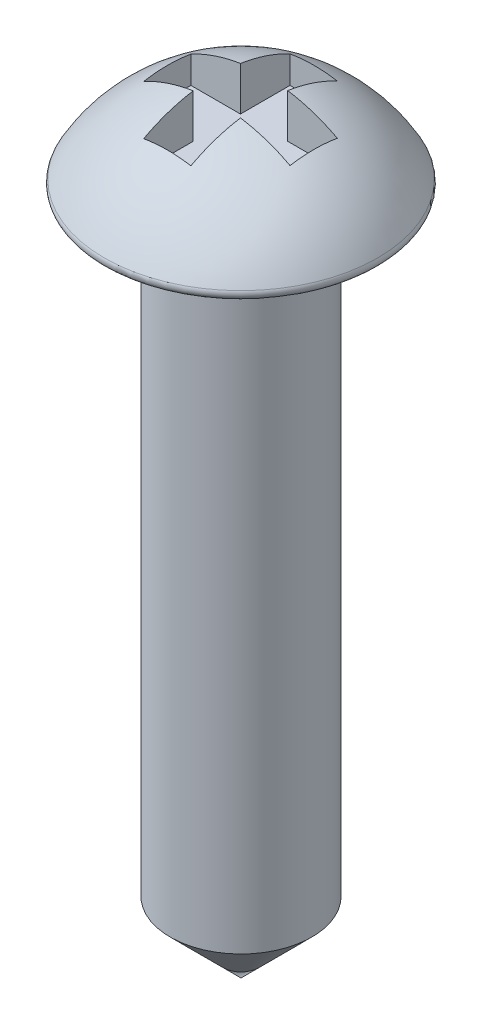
ISO-10303-21;
HEADER;
FILE_DESCRIPTION(('STEP AP214'),'2;1');
FILE_NAME('part.step','',(''),(''),'','','');
FILE_SCHEMA(('AUTOMOTIVE_DESIGN { 1 0 10303 214 1 1 1 1 }'));
ENDSEC;
DATA;
#1=APPLICATION_CONTEXT('core data for automotive mechanical design processes');
#2=APPLICATION_PROTOCOL_DEFINITION('international standard','automotive_design',2000,#1);
#3=PRODUCT_CONTEXT('',#1,'mechanical');
#4=PRODUCT('Part','Part','',(#3));
#5=PRODUCT_RELATED_PRODUCT_CATEGORY('part','',(#4));
#6=PRODUCT_DEFINITION_FORMATION('','',#4);
#7=PRODUCT_DEFINITION_CONTEXT('part definition',#1,'design');
#8=PRODUCT_DEFINITION('design','',#6,#7);
#9=PRODUCT_DEFINITION_SHAPE('','',#8);
#10=(LENGTH_UNIT() NAMED_UNIT(*) SI_UNIT(.MILLI.,.METRE.));
#11=(NAMED_UNIT(*) PLANE_ANGLE_UNIT() SI_UNIT($,.RADIAN.));
#12=(NAMED_UNIT(*) SI_UNIT($,.STERADIAN.) SOLID_ANGLE_UNIT());
#13=UNCERTAINTY_MEASURE_WITH_UNIT(LENGTH_MEASURE(1.E-05),#10,'distance_accuracy_value','');
#14=(GEOMETRIC_REPRESENTATION_CONTEXT(3) GLOBAL_UNCERTAINTY_ASSIGNED_CONTEXT((#13)) GLOBAL_UNIT_ASSIGNED_CONTEXT((#10,
#11,#12)) REPRESENTATION_CONTEXT('',''));
#15=CARTESIAN_POINT('',(0.,0.,0.));
#16=DIRECTION('',(0.,0.,1.));
#17=DIRECTION('',(1.,0.,0.));
#18=AXIS2_PLACEMENT_3D('',#15,#16,#17);
#19=CARTESIAN_POINT('',(0.,-10.6,0.));
#20=DIRECTION('',(0.,1.,0.));
#21=DIRECTION('',(-1.,0.,0.));
#22=AXIS2_PLACEMENT_3D('',#19,#20,#21);
#23=CONICAL_SURFACE('',#22,0.,0.785398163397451);
#24=CARTESIAN_POINT('',(0.,-9.5,0.));
#25=DIRECTION('',(0.,1.,0.));
#26=DIRECTION('',(-1.,0.,0.));
#27=AXIS2_PLACEMENT_3D('',#24,#25,#26);
#28=CIRCLE('',#27,1.1);
#29=CARTESIAN_POINT('',(-1.1,-9.5,0.));
#30=VERTEX_POINT('',#29);
#31=EDGE_CURVE('E202',#30,#30,#28,.T.);
#32=ORIENTED_EDGE('',*,*,#31,.F.);
#33=EDGE_LOOP('',(#32));
#34=FACE_BOUND('',#33,.T.);
#35=CARTESIAN_POINT('',(0.,-10.6,0.));
#36=VERTEX_POINT('',#35);
#37=VERTEX_LOOP('',#36);
#38=FACE_BOUND('',#37,.T.);
#39=ADVANCED_FACE('F33',(#34,#38),#23,.T.);
#40=CARTESIAN_POINT('',(0.,3.8000547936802,0.));
#41=DIRECTION('',(0.,1.,0.));
#42=DIRECTION('',(-1.,0.,0.));
#43=AXIS2_PLACEMENT_3D('',#40,#41,#42);
#44=CYLINDRICAL_SURFACE('',#43,1.1);
#45=CARTESIAN_POINT('',(0.,0.,0.));
#46=DIRECTION('',(0.,1.,0.));
#47=DIRECTION('',(-1.,0.,0.));
#48=AXIS2_PLACEMENT_3D('',#45,#46,#47);
#49=CIRCLE('',#48,1.1);
#50=CARTESIAN_POINT('',(-1.1,0.,0.));
#51=VERTEX_POINT('',#50);
#52=EDGE_CURVE('E171',#51,#51,#49,.T.);
#53=ORIENTED_EDGE('',*,*,#52,.F.);
#54=EDGE_LOOP('',(#53));
#55=FACE_BOUND('',#54,.T.);
#56=ORIENTED_EDGE('',*,*,#31,.T.);
#57=EDGE_LOOP('',(#56));
#58=FACE_BOUND('',#57,.T.);
#59=ADVANCED_FACE('F280',(#55,#58),#44,.T.);
#60=CARTESIAN_POINT('',(2.2,0.,0.));
#61=DIRECTION('',(0.,1.,0.));
#62=DIRECTION('',(-1.,0.,0.));
#63=AXIS2_PLACEMENT_3D('',#60,#61,#62);
#64=PLANE('',#63);
#65=CARTESIAN_POINT('',(0.,0.,0.));
#66=DIRECTION('',(0.,1.,0.));
#67=DIRECTION('',(-1.,0.,0.));
#68=AXIS2_PLACEMENT_3D('',#65,#66,#67);
#69=CIRCLE('',#68,2.0359463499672);
#70=CARTESIAN_POINT('',(-2.0359463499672,0.,0.));
#71=VERTEX_POINT('',#70);
#72=EDGE_CURVE('E208',#71,#71,#69,.F.);
#73=ORIENTED_EDGE('',*,*,#72,.T.);
#74=EDGE_LOOP('',(#73));
#75=FACE_BOUND('',#74,.T.);
#76=ORIENTED_EDGE('',*,*,#52,.T.);
#77=EDGE_LOOP('',(#76));
#78=FACE_BOUND('',#77,.T.);
#79=ADVANCED_FACE('F285',(#75,#78),#64,.F.);
#80=CARTESIAN_POINT('',(0.,-1.04082556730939,0.));
#81=DIRECTION('',(0.,1.,0.));
#82=DIRECTION('',(1.,0.,0.));
#83=AXIS2_PLACEMENT_3D('',#80,#81,#82);
#84=SPHERICAL_SURFACE('',#83,2.43378673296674);
#85=CARTESIAN_POINT('',(0.,-1.04082556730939,0.370388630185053));
#86=DIRECTION('',(0.,0.,1.));
#87=DIRECTION('',(1.,0.,0.));
#88=AXIS2_PLACEMENT_3D('',#85,#86,#87);
#89=CIRCLE('',#88,2.40543761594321);
#90=CARTESIAN_POINT('',(1.13232028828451,1.08143287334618,0.370388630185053));
#91=VERTEX_POINT('',#90);
#92=CARTESIAN_POINT('',(0.361948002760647,1.33722484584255,0.370388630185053));
#93=VERTEX_POINT('',#92);
#94=EDGE_CURVE('E211',#91,#93,#89,.T.);
#95=ORIENTED_EDGE('',*,*,#94,.T.);
#96=CARTESIAN_POINT('',(0.361948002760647,-1.04082556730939,0.));
#97=DIRECTION('',(1.,0.,0.));
#98=DIRECTION('',(0.,0.,-1.));
#99=AXIS2_PLACEMENT_3D('',#96,#97,#98);
#100=CIRCLE('',#99,2.40672214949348);
#101=CARTESIAN_POINT('',(0.361948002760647,1.07836674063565,1.14076091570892));
#102=VERTEX_POINT('',#101);
#103=EDGE_CURVE('E11',#93,#102,#100,.T.);
#104=ORIENTED_EDGE('',*,*,#103,.T.);
#105=CARTESIAN_POINT('',(0.,-1.04082556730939,1.14076091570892));
#106=DIRECTION('',(0.,0.,1.));
#107=DIRECTION('',(1.,0.,0.));
#108=AXIS2_PLACEMENT_3D('',#105,#106,#107);
#109=CIRCLE('',#108,2.14987962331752);
#110=CARTESIAN_POINT('',(-0.371599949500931,1.07669559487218,1.14076091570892));
#111=VERTEX_POINT('',#110);
#112=EDGE_CURVE('E41',#102,#111,#109,.T.);
#113=ORIENTED_EDGE('',*,*,#112,.T.);
#114=CARTESIAN_POINT('',(-0.371599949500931,-1.04082556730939,0.));
#115=DIRECTION('',(-1.,0.,0.));
#116=DIRECTION('',(0.,0.,1.));
#117=AXIS2_PLACEMENT_3D('',#114,#115,#116);
#118=CIRCLE('',#117,2.40525078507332);
#119=CARTESIAN_POINT('',(-0.371599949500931,1.3357357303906,0.370388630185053));
#120=VERTEX_POINT('',#119);
#121=EDGE_CURVE('E237',#111,#120,#118,.T.);
#122=ORIENTED_EDGE('',*,*,#121,.T.);
#123=CARTESIAN_POINT('',(0.,-1.04082556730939,0.370388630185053));
#124=DIRECTION('',(0.,0.,1.));
#125=DIRECTION('',(1.,0.,0.));
#126=AXIS2_PLACEMENT_3D('',#123,#124,#125);
#127=CIRCLE('',#126,2.40543761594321);
#128=CARTESIAN_POINT('',(-1.14197223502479,1.07625486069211,0.370388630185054));
#129=VERTEX_POINT('',#128);
#130=EDGE_CURVE('E234',#120,#129,#127,.T.);
#131=ORIENTED_EDGE('',*,*,#130,.T.);
#132=CARTESIAN_POINT('',(-1.14197223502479,-1.04082556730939,0.));
#133=DIRECTION('',(-1.,0.,0.));
#134=DIRECTION('',(0.,0.,1.));
#135=AXIS2_PLACEMENT_3D('',#132,#133,#134);
#136=CIRCLE('',#135,2.14923644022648);
#137=CARTESIAN_POINT('',(-1.14197223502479,1.07750693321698,-0.363159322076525));
#138=VERTEX_POINT('',#137);
#139=EDGE_CURVE('E231',#129,#138,#136,.T.);
#140=ORIENTED_EDGE('',*,*,#139,.T.);
#141=CARTESIAN_POINT('',(0.,-1.04082556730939,-0.363159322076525));
#142=DIRECTION('',(0.,0.,-1.));
#143=DIRECTION('',(-1.,0.,0.));
#144=AXIS2_PLACEMENT_3D('',#141,#142,#143);
#145=CIRCLE('',#144,2.40653966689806);
#146=CARTESIAN_POINT('',(-0.371599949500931,1.33685116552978,-0.363159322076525));
#147=VERTEX_POINT('',#146);
#148=EDGE_CURVE('E228',#138,#147,#145,.T.);
#149=ORIENTED_EDGE('',*,*,#148,.T.);
#150=CARTESIAN_POINT('',(-0.371599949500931,-1.04082556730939,0.));
#151=DIRECTION('',(-1.,0.,0.));
#152=DIRECTION('',(0.,0.,1.));
#153=AXIS2_PLACEMENT_3D('',#150,#151,#152);
#154=CIRCLE('',#153,2.40525078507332);
#155=CARTESIAN_POINT('',(-0.371599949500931,1.08057430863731,-1.13353160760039));
#156=VERTEX_POINT('',#155);
#157=EDGE_CURVE('E225',#147,#156,#154,.T.);
#158=ORIENTED_EDGE('',*,*,#157,.T.);
#159=CARTESIAN_POINT('',(0.,-1.04082556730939,-1.13353160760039));
#160=DIRECTION('',(0.,0.,-1.));
#161=DIRECTION('',(-1.,0.,0.));
#162=AXIS2_PLACEMENT_3D('',#159,#160,#161);
#163=CIRCLE('',#162,2.15370006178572);
#164=CARTESIAN_POINT('',(0.361948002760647,1.08224240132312,-1.13353160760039));
#165=VERTEX_POINT('',#164);
#166=EDGE_CURVE('E222',#156,#165,#163,.T.);
#167=ORIENTED_EDGE('',*,*,#166,.T.);
#168=CARTESIAN_POINT('',(0.361948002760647,-1.04082556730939,0.));
#169=DIRECTION('',(1.,0.,0.));
#170=DIRECTION('',(0.,0.,-1.));
#171=AXIS2_PLACEMENT_3D('',#168,#169,#170);
#172=CIRCLE('',#171,2.40672214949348);
#173=CARTESIAN_POINT('',(0.361948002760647,1.33833958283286,-0.363159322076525));
#174=VERTEX_POINT('',#173);
#175=EDGE_CURVE('E219',#165,#174,#172,.T.);
#176=ORIENTED_EDGE('',*,*,#175,.T.);
#177=CARTESIAN_POINT('',(0.,-1.04082556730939,-0.363159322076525));
#178=DIRECTION('',(0.,0.,-1.));
#179=DIRECTION('',(-1.,0.,0.));
#180=AXIS2_PLACEMENT_3D('',#177,#178,#179);
#181=CIRCLE('',#180,2.40653966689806);
#182=CARTESIAN_POINT('',(1.13232028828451,1.0826818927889,-0.363159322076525));
#183=VERTEX_POINT('',#182);
#184=EDGE_CURVE('E216',#174,#183,#181,.T.);
#185=ORIENTED_EDGE('',*,*,#184,.T.);
#186=CARTESIAN_POINT('',(1.13232028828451,-1.04082556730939,0.));
#187=DIRECTION('',(1.,0.,0.));
#188=DIRECTION('',(0.,0.,-1.));
#189=AXIS2_PLACEMENT_3D('',#186,#187,#188);
#190=CIRCLE('',#189,2.15433716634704);
#191=EDGE_CURVE('E213',#183,#91,#190,.T.);
#192=ORIENTED_EDGE('',*,*,#191,.T.);
#193=EDGE_LOOP('',(#95,#104,#113,#122,#131,#140,#149,#158,#167,#176,#185,#192));
#194=FACE_BOUND('',#193,.T.);
#195=CARTESIAN_POINT('',(0.,0.148883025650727,0.));
#196=DIRECTION('',(0.,-1.,0.));
#197=DIRECTION('',(1.,0.,0.));
#198=AXIS2_PLACEMENT_3D('',#195,#196,#197);
#199=CIRCLE('',#198,2.12318424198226);
#200=CARTESIAN_POINT('',(2.12318424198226,0.148883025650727,0.));
#201=VERTEX_POINT('',#200);
#202=EDGE_CURVE('E205',#201,#201,#199,.F.);
#203=ORIENTED_EDGE('',*,*,#202,.T.);
#204=EDGE_LOOP('',(#203));
#205=FACE_BOUND('',#204,.T.);
#206=ADVANCED_FACE('F241',(#194,#205),#84,.T.);
#207=CARTESIAN_POINT('',(0.,0.0999999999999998,0.));
#208=DIRECTION('',(0.,1.,0.));
#209=DIRECTION('',(-1.,0.,0.));
#210=AXIS2_PLACEMENT_3D('',#207,#208,#209);
#211=TOROIDAL_SURFACE('',#210,2.0359463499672,0.1);
#212=ORIENTED_EDGE('',*,*,#72,.F.);
#213=EDGE_LOOP('',(#212));
#214=FACE_BOUND('',#213,.T.);
#215=ORIENTED_EDGE('',*,*,#202,.F.);
#216=EDGE_LOOP('',(#215));
#217=FACE_BOUND('',#216,.T.);
#218=ADVANCED_FACE('F35',(#214,#217),#211,.T.);
#219=CARTESIAN_POINT('',(0.361948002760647,0.656537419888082,1.14076091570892));
#220=DIRECTION('',(1.,0.,0.));
#221=DIRECTION('',(0.,0.,-1.));
#222=AXIS2_PLACEMENT_3D('',#219,#220,#221);
#223=PLANE('',#222);
#224=DIRECTION('',(0.,1.,0.));
#225=VECTOR('',#224,1.);
#226=CARTESIAN_POINT('',(0.361948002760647,0.656537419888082,0.370388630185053));
#227=LINE('',#226,#225);
#228=CARTESIAN_POINT('',(0.361948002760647,0.656537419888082,0.370388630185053));
#229=VERTEX_POINT('',#228);
#230=EDGE_CURVE('E48',#229,#93,#227,.T.);
#231=ORIENTED_EDGE('',*,*,#230,.F.);
#232=DIRECTION('',(0.,0.,-1.));
#233=VECTOR('',#232,1.);
#234=CARTESIAN_POINT('',(0.361948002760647,0.656537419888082,1.14076091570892));
#235=LINE('',#234,#233);
#236=CARTESIAN_POINT('',(0.361948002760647,0.656537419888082,1.14076091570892));
#237=VERTEX_POINT('',#236);
#238=EDGE_CURVE('E124',#237,#229,#235,.T.);
#239=ORIENTED_EDGE('',*,*,#238,.F.);
#240=DIRECTION('',(0.,1.,0.));
#241=VECTOR('',#240,1.);
#242=CARTESIAN_POINT('',(0.361948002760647,0.656537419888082,1.14076091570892));
#243=LINE('',#242,#241);
#244=EDGE_CURVE('E169',#237,#102,#243,.T.);
#245=ORIENTED_EDGE('',*,*,#244,.T.);
#246=ORIENTED_EDGE('',*,*,#103,.F.);
#247=EDGE_LOOP('',(#231,#239,#245,#246));
#248=FACE_BOUND('',#247,.T.);
#249=ADVANCED_FACE('F121',(#248),#223,.F.);
#250=CARTESIAN_POINT('',(0.361948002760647,0.656537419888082,1.14076091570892));
#251=DIRECTION('',(0.,0.,1.));
#252=DIRECTION('',(1.,0.,0.));
#253=AXIS2_PLACEMENT_3D('',#250,#251,#252);
#254=PLANE('',#253);
#255=ORIENTED_EDGE('',*,*,#244,.F.);
#256=DIRECTION('',(1.,0.,0.));
#257=VECTOR('',#256,1.);
#258=CARTESIAN_POINT('',(0.361948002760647,0.656537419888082,1.14076091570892));
#259=LINE('',#258,#257);
#260=CARTESIAN_POINT('',(-0.371599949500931,0.656537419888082,1.14076091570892));
#261=VERTEX_POINT('',#260);
#262=EDGE_CURVE('E128',#261,#237,#259,.T.);
#263=ORIENTED_EDGE('',*,*,#262,.F.);
#264=DIRECTION('',(0.,1.,0.));
#265=VECTOR('',#264,1.);
#266=CARTESIAN_POINT('',(-0.371599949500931,0.656537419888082,1.14076091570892));
#267=LINE('',#266,#265);
#268=EDGE_CURVE('E172',#261,#111,#267,.T.);
#269=ORIENTED_EDGE('',*,*,#268,.T.);
#270=ORIENTED_EDGE('',*,*,#112,.F.);
#271=EDGE_LOOP('',(#255,#263,#269,#270));
#272=FACE_BOUND('',#271,.T.);
#273=ADVANCED_FACE('F244',(#272),#254,.F.);
#274=CARTESIAN_POINT('',(-0.371599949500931,0.656537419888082,1.14076091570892));
#275=DIRECTION('',(-1.,0.,0.));
#276=DIRECTION('',(0.,0.,1.));
#277=AXIS2_PLACEMENT_3D('',#274,#275,#276);
#278=PLANE('',#277);
#279=ORIENTED_EDGE('',*,*,#268,.F.);
#280=DIRECTION('',(0.,0.,1.));
#281=VECTOR('',#280,1.);
#282=CARTESIAN_POINT('',(-0.371599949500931,0.656537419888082,1.14076091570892));
#283=LINE('',#282,#281);
#284=CARTESIAN_POINT('',(-0.371599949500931,0.656537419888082,0.370388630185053));
#285=VERTEX_POINT('',#284);
#286=EDGE_CURVE('E166',#285,#261,#283,.T.);
#287=ORIENTED_EDGE('',*,*,#286,.F.);
#288=DIRECTION('',(0.,1.,0.));
#289=VECTOR('',#288,1.);
#290=CARTESIAN_POINT('',(-0.371599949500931,0.656537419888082,0.370388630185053));
#291=LINE('',#290,#289);
#292=EDGE_CURVE('E175',#285,#120,#291,.T.);
#293=ORIENTED_EDGE('',*,*,#292,.T.);
#294=ORIENTED_EDGE('',*,*,#121,.F.);
#295=EDGE_LOOP('',(#279,#287,#293,#294));
#296=FACE_BOUND('',#295,.T.);
#297=ADVANCED_FACE('F247',(#296),#278,.F.);
#298=CARTESIAN_POINT('',(-0.371599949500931,0.656537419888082,0.370388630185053));
#299=DIRECTION('',(0.,0.,1.));
#300=DIRECTION('',(1.,0.,0.));
#301=AXIS2_PLACEMENT_3D('',#298,#299,#300);
#302=PLANE('',#301);
#303=ORIENTED_EDGE('',*,*,#292,.F.);
#304=DIRECTION('',(1.,0.,0.));
#305=VECTOR('',#304,1.);
#306=CARTESIAN_POINT('',(-0.371599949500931,0.656537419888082,0.370388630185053));
#307=LINE('',#306,#305);
#308=CARTESIAN_POINT('',(-1.14197223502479,0.656537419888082,0.370388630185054));
#309=VERTEX_POINT('',#308);
#310=EDGE_CURVE('E163',#309,#285,#307,.T.);
#311=ORIENTED_EDGE('',*,*,#310,.F.);
#312=DIRECTION('',(0.,1.,0.));
#313=VECTOR('',#312,1.);
#314=CARTESIAN_POINT('',(-1.14197223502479,0.656537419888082,0.370388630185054));
#315=LINE('',#314,#313);
#316=EDGE_CURVE('E178',#309,#129,#315,.T.);
#317=ORIENTED_EDGE('',*,*,#316,.T.);
#318=ORIENTED_EDGE('',*,*,#130,.F.);
#319=EDGE_LOOP('',(#303,#311,#317,#318));
#320=FACE_BOUND('',#319,.T.);
#321=ADVANCED_FACE('F251',(#320),#302,.F.);
#322=CARTESIAN_POINT('',(-1.14197223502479,0.656537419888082,0.370388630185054));
#323=DIRECTION('',(-1.,0.,0.));
#324=DIRECTION('',(0.,0.,1.));
#325=AXIS2_PLACEMENT_3D('',#322,#323,#324);
#326=PLANE('',#325);
#327=ORIENTED_EDGE('',*,*,#316,.F.);
#328=DIRECTION('',(0.,0.,1.));
#329=VECTOR('',#328,1.);
#330=CARTESIAN_POINT('',(-1.14197223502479,0.656537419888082,0.370388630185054));
#331=LINE('',#330,#329);
#332=CARTESIAN_POINT('',(-1.14197223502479,0.656537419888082,-0.363159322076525));
#333=VERTEX_POINT('',#332);
#334=EDGE_CURVE('E160',#333,#309,#331,.T.);
#335=ORIENTED_EDGE('',*,*,#334,.F.);
#336=DIRECTION('',(0.,1.,0.));
#337=VECTOR('',#336,1.);
#338=CARTESIAN_POINT('',(-1.14197223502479,0.656537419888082,-0.363159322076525));
#339=LINE('',#338,#337);
#340=EDGE_CURVE('E181',#333,#138,#339,.T.);
#341=ORIENTED_EDGE('',*,*,#340,.T.);
#342=ORIENTED_EDGE('',*,*,#139,.F.);
#343=EDGE_LOOP('',(#327,#335,#341,#342));
#344=FACE_BOUND('',#343,.T.);
#345=ADVANCED_FACE('F253',(#344),#326,.F.);
#346=CARTESIAN_POINT('',(-0.371599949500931,0.656537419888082,-0.363159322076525));
#347=DIRECTION('',(0.,0.,-1.));
#348=DIRECTION('',(-1.,0.,0.));
#349=AXIS2_PLACEMENT_3D('',#346,#347,#348);
#350=PLANE('',#349);
#351=ORIENTED_EDGE('',*,*,#340,.F.);
#352=DIRECTION('',(-1.,0.,0.));
#353=VECTOR('',#352,1.);
#354=CARTESIAN_POINT('',(-0.371599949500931,0.656537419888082,-0.363159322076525));
#355=LINE('',#354,#353);
#356=CARTESIAN_POINT('',(-0.371599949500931,0.656537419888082,-0.363159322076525));
#357=VERTEX_POINT('',#356);
#358=EDGE_CURVE('E157',#357,#333,#355,.T.);
#359=ORIENTED_EDGE('',*,*,#358,.F.);
#360=DIRECTION('',(0.,1.,0.));
#361=VECTOR('',#360,1.);
#362=CARTESIAN_POINT('',(-0.371599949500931,0.656537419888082,-0.363159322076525));
#363=LINE('',#362,#361);
#364=EDGE_CURVE('E184',#357,#147,#363,.T.);
#365=ORIENTED_EDGE('',*,*,#364,.T.);
#366=ORIENTED_EDGE('',*,*,#148,.F.);
#367=EDGE_LOOP('',(#351,#359,#365,#366));
#368=FACE_BOUND('',#367,.T.);
#369=ADVANCED_FACE('F256',(#368),#350,.F.);
#370=CARTESIAN_POINT('',(-0.371599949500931,0.656537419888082,-0.363159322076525));
#371=DIRECTION('',(-1.,0.,0.));
#372=DIRECTION('',(0.,0.,1.));
#373=AXIS2_PLACEMENT_3D('',#370,#371,#372);
#374=PLANE('',#373);
#375=ORIENTED_EDGE('',*,*,#364,.F.);
#376=DIRECTION('',(0.,0.,1.));
#377=VECTOR('',#376,1.);
#378=CARTESIAN_POINT('',(-0.371599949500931,0.656537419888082,-0.363159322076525));
#379=LINE('',#378,#377);
#380=CARTESIAN_POINT('',(-0.371599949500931,0.656537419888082,-1.13353160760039));
#381=VERTEX_POINT('',#380);
#382=EDGE_CURVE('E154',#381,#357,#379,.T.);
#383=ORIENTED_EDGE('',*,*,#382,.F.);
#384=DIRECTION('',(0.,1.,0.));
#385=VECTOR('',#384,1.);
#386=CARTESIAN_POINT('',(-0.371599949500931,0.656537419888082,-1.13353160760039));
#387=LINE('',#386,#385);
#388=EDGE_CURVE('E187',#381,#156,#387,.T.);
#389=ORIENTED_EDGE('',*,*,#388,.T.);
#390=ORIENTED_EDGE('',*,*,#157,.F.);
#391=EDGE_LOOP('',(#375,#383,#389,#390));
#392=FACE_BOUND('',#391,.T.);
#393=ADVANCED_FACE('F259',(#392),#374,.F.);
#394=CARTESIAN_POINT('',(0.361948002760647,0.656537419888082,-1.13353160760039));
#395=DIRECTION('',(0.,0.,-1.));
#396=DIRECTION('',(-1.,0.,0.));
#397=AXIS2_PLACEMENT_3D('',#394,#395,#396);
#398=PLANE('',#397);
#399=ORIENTED_EDGE('',*,*,#388,.F.);
#400=DIRECTION('',(-1.,0.,0.));
#401=VECTOR('',#400,1.);
#402=CARTESIAN_POINT('',(0.361948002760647,0.656537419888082,-1.13353160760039));
#403=LINE('',#402,#401);
#404=CARTESIAN_POINT('',(0.361948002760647,0.656537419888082,-1.13353160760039));
#405=VERTEX_POINT('',#404);
#406=EDGE_CURVE('E151',#405,#381,#403,.T.);
#407=ORIENTED_EDGE('',*,*,#406,.F.);
#408=DIRECTION('',(0.,1.,0.));
#409=VECTOR('',#408,1.);
#410=CARTESIAN_POINT('',(0.361948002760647,0.656537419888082,-1.13353160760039));
#411=LINE('',#410,#409);
#412=EDGE_CURVE('E190',#405,#165,#411,.T.);
#413=ORIENTED_EDGE('',*,*,#412,.T.);
#414=ORIENTED_EDGE('',*,*,#166,.F.);
#415=EDGE_LOOP('',(#399,#407,#413,#414));
#416=FACE_BOUND('',#415,.T.);
#417=ADVANCED_FACE('F261',(#416),#398,.F.);
#418=CARTESIAN_POINT('',(0.361948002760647,0.656537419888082,-0.363159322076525));
#419=DIRECTION('',(1.,0.,0.));
#420=DIRECTION('',(0.,0.,-1.));
#421=AXIS2_PLACEMENT_3D('',#418,#419,#420);
#422=PLANE('',#421);
#423=ORIENTED_EDGE('',*,*,#412,.F.);
#424=DIRECTION('',(0.,0.,-1.));
#425=VECTOR('',#424,1.);
#426=CARTESIAN_POINT('',(0.361948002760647,0.656537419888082,-0.363159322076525));
#427=LINE('',#426,#425);
#428=CARTESIAN_POINT('',(0.361948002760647,0.656537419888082,-0.363159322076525));
#429=VERTEX_POINT('',#428);
#430=EDGE_CURVE('E148',#429,#405,#427,.T.);
#431=ORIENTED_EDGE('',*,*,#430,.F.);
#432=DIRECTION('',(0.,1.,0.));
#433=VECTOR('',#432,1.);
#434=CARTESIAN_POINT('',(0.361948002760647,0.656537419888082,-0.363159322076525));
#435=LINE('',#434,#433);
#436=EDGE_CURVE('E193',#429,#174,#435,.T.);
#437=ORIENTED_EDGE('',*,*,#436,.T.);
#438=ORIENTED_EDGE('',*,*,#175,.F.);
#439=EDGE_LOOP('',(#423,#431,#437,#438));
#440=FACE_BOUND('',#439,.T.);
#441=ADVANCED_FACE('F265',(#440),#422,.F.);
#442=CARTESIAN_POINT('',(1.13232028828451,0.656537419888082,-0.363159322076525));
#443=DIRECTION('',(0.,0.,-1.));
#444=DIRECTION('',(-1.,0.,0.));
#445=AXIS2_PLACEMENT_3D('',#442,#443,#444);
#446=PLANE('',#445);
#447=ORIENTED_EDGE('',*,*,#436,.F.);
#448=DIRECTION('',(-1.,0.,0.));
#449=VECTOR('',#448,1.);
#450=CARTESIAN_POINT('',(1.13232028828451,0.656537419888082,-0.363159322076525));
#451=LINE('',#450,#449);
#452=CARTESIAN_POINT('',(1.13232028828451,0.656537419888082,-0.363159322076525));
#453=VERTEX_POINT('',#452);
#454=EDGE_CURVE('E145',#453,#429,#451,.T.);
#455=ORIENTED_EDGE('',*,*,#454,.F.);
#456=DIRECTION('',(0.,1.,0.));
#457=VECTOR('',#456,1.);
#458=CARTESIAN_POINT('',(1.13232028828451,0.656537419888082,-0.363159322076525));
#459=LINE('',#458,#457);
#460=EDGE_CURVE('E196',#453,#183,#459,.T.);
#461=ORIENTED_EDGE('',*,*,#460,.T.);
#462=ORIENTED_EDGE('',*,*,#184,.F.);
#463=EDGE_LOOP('',(#447,#455,#461,#462));
#464=FACE_BOUND('',#463,.T.);
#465=ADVANCED_FACE('F268',(#464),#446,.F.);
#466=CARTESIAN_POINT('',(1.13232028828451,0.656537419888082,0.370388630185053));
#467=DIRECTION('',(1.,0.,0.));
#468=DIRECTION('',(0.,0.,-1.));
#469=AXIS2_PLACEMENT_3D('',#466,#467,#468);
#470=PLANE('',#469);
#471=ORIENTED_EDGE('',*,*,#460,.F.);
#472=DIRECTION('',(0.,0.,-1.));
#473=VECTOR('',#472,1.);
#474=CARTESIAN_POINT('',(1.13232028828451,0.656537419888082,0.370388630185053));
#475=LINE('',#474,#473);
#476=CARTESIAN_POINT('',(1.13232028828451,0.656537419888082,0.370388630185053));
#477=VERTEX_POINT('',#476);
#478=EDGE_CURVE('E137',#477,#453,#475,.T.);
#479=ORIENTED_EDGE('',*,*,#478,.F.);
#480=DIRECTION('',(0.,1.,0.));
#481=VECTOR('',#480,1.);
#482=CARTESIAN_POINT('',(1.13232028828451,0.656537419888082,0.370388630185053));
#483=LINE('',#482,#481);
#484=EDGE_CURVE('E127',#477,#91,#483,.T.);
#485=ORIENTED_EDGE('',*,*,#484,.T.);
#486=ORIENTED_EDGE('',*,*,#191,.F.);
#487=EDGE_LOOP('',(#471,#479,#485,#486));
#488=FACE_BOUND('',#487,.T.);
#489=ADVANCED_FACE('F270',(#488),#470,.F.);
#490=CARTESIAN_POINT('',(1.13232028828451,0.656537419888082,0.370388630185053));
#491=DIRECTION('',(0.,0.,1.));
#492=DIRECTION('',(1.,0.,0.));
#493=AXIS2_PLACEMENT_3D('',#490,#491,#492);
#494=PLANE('',#493);
#495=ORIENTED_EDGE('',*,*,#484,.F.);
#496=DIRECTION('',(1.,0.,0.));
#497=VECTOR('',#496,1.);
#498=CARTESIAN_POINT('',(1.13232028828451,0.656537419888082,0.370388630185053));
#499=LINE('',#498,#497);
#500=EDGE_CURVE('E131',#229,#477,#499,.T.);
#501=ORIENTED_EDGE('',*,*,#500,.F.);
#502=ORIENTED_EDGE('',*,*,#230,.T.);
#503=ORIENTED_EDGE('',*,*,#94,.F.);
#504=EDGE_LOOP('',(#495,#501,#502,#503));
#505=FACE_BOUND('',#504,.T.);
#506=ADVANCED_FACE('F132',(#505),#494,.F.);
#507=CARTESIAN_POINT('',(0.361948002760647,0.656537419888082,-1.13353160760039));
#508=DIRECTION('',(0.,1.,0.));
#509=DIRECTION('',(0.,0.,1.));
#510=AXIS2_PLACEMENT_3D('',#507,#508,#509);
#511=PLANE('',#510);
#512=ORIENTED_EDGE('',*,*,#238,.T.);
#513=ORIENTED_EDGE('',*,*,#500,.T.);
#514=ORIENTED_EDGE('',*,*,#478,.T.);
#515=ORIENTED_EDGE('',*,*,#454,.T.);
#516=ORIENTED_EDGE('',*,*,#430,.T.);
#517=ORIENTED_EDGE('',*,*,#406,.T.);
#518=ORIENTED_EDGE('',*,*,#382,.T.);
#519=ORIENTED_EDGE('',*,*,#358,.T.);
#520=ORIENTED_EDGE('',*,*,#334,.T.);
#521=ORIENTED_EDGE('',*,*,#310,.T.);
#522=ORIENTED_EDGE('',*,*,#286,.T.);
#523=ORIENTED_EDGE('',*,*,#262,.T.);
#524=EDGE_LOOP('',(#512,#513,#514,#515,#516,#517,#518,#519,#520,#521,#522,#523));
#525=FACE_BOUND('',#524,.T.);
#526=ADVANCED_FACE('F139',(#525),#511,.T.);
#527=CLOSED_SHELL('',(#39,#59,#79,#206,#218,#249,#273,#297,#321,#345,#369,#393,#417,#441,#465,
#489,#506,#526));
#528=MANIFOLD_SOLID_BREP('B2',#527);
#529=ADVANCED_BREP_SHAPE_REPRESENTATION('',(#18,#528),#14);
#530=SHAPE_DEFINITION_REPRESENTATION(#9,#529);
ENDSEC;
END-ISO-10303-21;
